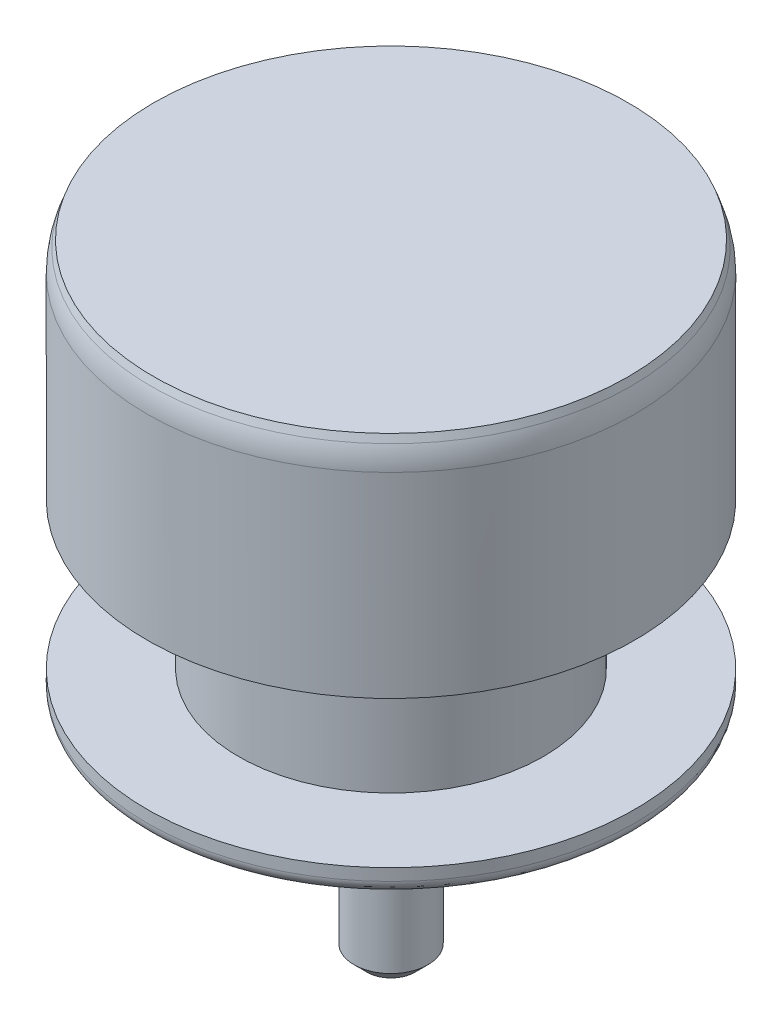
ISO-10303-21;
HEADER;
FILE_DESCRIPTION(('STEP AP214'),'2;1');
FILE_NAME('part.step','',(''),(''),'','','');
FILE_SCHEMA(('AUTOMOTIVE_DESIGN { 1 0 10303 214 1 1 1 1 }'));
ENDSEC;
DATA;
#1=APPLICATION_CONTEXT('core data for automotive mechanical design processes');
#2=APPLICATION_PROTOCOL_DEFINITION('international standard','automotive_design',2000,#1);
#3=PRODUCT_CONTEXT('',#1,'mechanical');
#4=PRODUCT('Part','Part','',(#3));
#5=PRODUCT_RELATED_PRODUCT_CATEGORY('part','',(#4));
#6=PRODUCT_DEFINITION_FORMATION('','',#4);
#7=PRODUCT_DEFINITION_CONTEXT('part definition',#1,'design');
#8=PRODUCT_DEFINITION('design','',#6,#7);
#9=PRODUCT_DEFINITION_SHAPE('','',#8);
#10=(LENGTH_UNIT() NAMED_UNIT(*) SI_UNIT(.MILLI.,.METRE.));
#11=(NAMED_UNIT(*) PLANE_ANGLE_UNIT() SI_UNIT($,.RADIAN.));
#12=(NAMED_UNIT(*) SI_UNIT($,.STERADIAN.) SOLID_ANGLE_UNIT());
#13=UNCERTAINTY_MEASURE_WITH_UNIT(LENGTH_MEASURE(1.E-05),#10,'distance_accuracy_value','');
#14=(GEOMETRIC_REPRESENTATION_CONTEXT(3) GLOBAL_UNCERTAINTY_ASSIGNED_CONTEXT((#13)) GLOBAL_UNIT_ASSIGNED_CONTEXT((#10,
#11,#12)) REPRESENTATION_CONTEXT('',''));
#15=CARTESIAN_POINT('',(0.,0.,0.));
#16=DIRECTION('',(0.,0.,1.));
#17=DIRECTION('',(1.,0.,0.));
#18=AXIS2_PLACEMENT_3D('',#15,#16,#17);
#19=CARTESIAN_POINT('',(3.66,0.,0.));
#20=DIRECTION('',(0.,-1.,0.));
#21=DIRECTION('',(1.,0.,0.));
#22=AXIS2_PLACEMENT_3D('',#19,#20,#21);
#23=PLANE('',#22);
#24=CARTESIAN_POINT('',(0.,0.,0.));
#25=DIRECTION('',(0.,1.,0.));
#26=DIRECTION('',(-1.,0.,0.));
#27=AXIS2_PLACEMENT_3D('',#24,#25,#26);
#28=CIRCLE('',#27,3.66);
#29=CARTESIAN_POINT('',(-3.66,0.,0.));
#30=VERTEX_POINT('',#29);
#31=EDGE_CURVE('E73',#30,#30,#28,.T.);
#32=ORIENTED_EDGE('',*,*,#31,.T.);
#33=EDGE_LOOP('',(#32));
#34=FACE_BOUND('',#33,.T.);
#35=ADVANCED_FACE('F32',(#34),#23,.F.);
#36=CARTESIAN_POINT('',(0.570000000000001,-9.6,0.));
#37=DIRECTION('',(0.,1.,0.));
#38=DIRECTION('',(-1.,0.,0.));
#39=AXIS2_PLACEMENT_3D('',#36,#37,#38);
#40=PLANE('',#39);
#41=CARTESIAN_POINT('',(0.,-9.6,0.));
#42=DIRECTION('',(0.,1.,0.));
#43=DIRECTION('',(-1.,0.,0.));
#44=AXIS2_PLACEMENT_3D('',#41,#42,#43);
#45=CIRCLE('',#44,0.369999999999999);
#46=CARTESIAN_POINT('',(-0.369999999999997,-9.6,0.));
#47=VERTEX_POINT('',#46);
#48=EDGE_CURVE('E10',#47,#47,#45,.F.);
#49=ORIENTED_EDGE('',*,*,#48,.T.);
#50=EDGE_LOOP('',(#49));
#51=FACE_BOUND('',#50,.T.);
#52=ADVANCED_FACE('F95',(#51),#40,.F.);
#53=CARTESIAN_POINT('',(0.,0.,0.));
#54=DIRECTION('',(0.,1.,0.));
#55=DIRECTION('',(-1.,0.,0.));
#56=AXIS2_PLACEMENT_3D('',#53,#54,#55);
#57=CYLINDRICAL_SURFACE('',#56,0.57);
#58=CARTESIAN_POINT('',(0.,-9.4,0.));
#59=DIRECTION('',(0.,1.,0.));
#60=DIRECTION('',(-1.,0.,0.));
#61=AXIS2_PLACEMENT_3D('',#58,#59,#60);
#62=CIRCLE('',#61,0.57);
#63=CARTESIAN_POINT('',(-0.569999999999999,-9.4,0.));
#64=VERTEX_POINT('',#63);
#65=EDGE_CURVE('E39',#64,#64,#62,.T.);
#66=ORIENTED_EDGE('',*,*,#65,.T.);
#67=EDGE_LOOP('',(#66));
#68=FACE_BOUND('',#67,.T.);
#69=CARTESIAN_POINT('',(0.,-7.87091034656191,0.));
#70=DIRECTION('',(0.,1.,0.));
#71=DIRECTION('',(-1.,0.,0.));
#72=AXIS2_PLACEMENT_3D('',#69,#70,#71);
#73=CIRCLE('',#72,0.57);
#74=CARTESIAN_POINT('',(-0.569999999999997,-7.87091034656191,0.));
#75=VERTEX_POINT('',#74);
#76=EDGE_CURVE('E58',#75,#75,#73,.T.);
#77=ORIENTED_EDGE('',*,*,#76,.F.);
#78=EDGE_LOOP('',(#77));
#79=FACE_BOUND('',#78,.T.);
#80=ADVANCED_FACE('F100',(#68,#79),#57,.T.);
#81=CARTESIAN_POINT('',(0.,-7.87091034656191,0.));
#82=DIRECTION('',(0.,1.,0.));
#83=DIRECTION('',(-1.,0.,0.));
#84=AXIS2_PLACEMENT_3D('',#81,#82,#83);
#85=CONICAL_SURFACE('',#84,0.57,1.04719755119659);
#86=CARTESIAN_POINT('',(0.,-6.08689801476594,0.));
#87=DIRECTION('',(0.,-1.,0.));
#88=DIRECTION('',(1.,0.,0.));
#89=AXIS2_PLACEMENT_3D('',#86,#87,#88);
#90=CIRCLE('',#89,3.66);
#91=CARTESIAN_POINT('',(-3.66,-6.08689801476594,0.));
#92=VERTEX_POINT('',#91);
#93=EDGE_CURVE('E52',#92,#92,#90,.T.);
#94=CARTESIAN_POINT('',(-3.66,-6.08689801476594,0.));
#95=CARTESIAN_POINT('',(-3.6278125,-6.10548147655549,0.));
#96=CARTESIAN_POINT('',(-3.595625,-6.12406493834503,0.));
#97=CARTESIAN_POINT('',(-3.53125,-6.16123186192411,0.));
#98=CARTESIAN_POINT('',(-3.4990625,-6.17981532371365,0.));
#99=CARTESIAN_POINT('',(-3.4346875,-6.21698224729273,0.));
#100=CARTESIAN_POINT('',(-3.4025,-6.23556570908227,0.));
#101=CARTESIAN_POINT('',(-3.338125,-6.27273263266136,0.));
#102=CARTESIAN_POINT('',(-3.3059375,-6.2913160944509,0.));
#103=CARTESIAN_POINT('',(-3.2415625,-6.32848301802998,0.));
#104=CARTESIAN_POINT('',(-3.209375,-6.34706647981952,0.));
#105=CARTESIAN_POINT('',(-3.145,-6.3842334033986,0.));
#106=CARTESIAN_POINT('',(-3.1128125,-6.40281686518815,0.));
#107=CARTESIAN_POINT('',(-3.0484375,-6.43998378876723,0.));
#108=CARTESIAN_POINT('',(-3.01625,-6.45856725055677,0.));
#109=CARTESIAN_POINT('',(-2.951875,-6.49573417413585,0.));
#110=CARTESIAN_POINT('',(-2.9196875,-6.51431763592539,0.));
#111=CARTESIAN_POINT('',(-2.8553125,-6.55148455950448,0.));
#112=CARTESIAN_POINT('',(-2.823125,-6.57006802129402,0.));
#113=CARTESIAN_POINT('',(-2.75875,-6.6072349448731,0.));
#114=CARTESIAN_POINT('',(-2.7265625,-6.62581840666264,0.));
#115=CARTESIAN_POINT('',(-2.6621875,-6.66298533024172,0.));
#116=CARTESIAN_POINT('',(-2.63,-6.68156879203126,0.));
#117=CARTESIAN_POINT('',(-2.565625,-6.71873571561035,0.));
#118=CARTESIAN_POINT('',(-2.5334375,-6.73731917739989,0.));
#119=CARTESIAN_POINT('',(-2.4690625,-6.77448610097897,0.));
#120=CARTESIAN_POINT('',(-2.436875,-6.79306956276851,0.));
#121=CARTESIAN_POINT('',(-2.3725,-6.8302364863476,0.));
#122=CARTESIAN_POINT('',(-2.3403125,-6.84881994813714,0.));
#123=CARTESIAN_POINT('',(-2.2759375,-6.88598687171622,0.));
#124=CARTESIAN_POINT('',(-2.24375,-6.90457033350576,0.));
#125=CARTESIAN_POINT('',(-2.179375,-6.94173725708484,0.));
#126=CARTESIAN_POINT('',(-2.1471875,-6.96032071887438,0.));
#127=CARTESIAN_POINT('',(-2.0828125,-6.99748764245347,0.));
#128=CARTESIAN_POINT('',(-2.050625,-7.01607110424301,0.));
#129=CARTESIAN_POINT('',(-1.98625,-7.05323802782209,0.));
#130=CARTESIAN_POINT('',(-1.9540625,-7.07182148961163,0.));
#131=CARTESIAN_POINT('',(-1.8896875,-7.10898841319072,0.));
#132=CARTESIAN_POINT('',(-1.8575,-7.12757187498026,0.));
#133=CARTESIAN_POINT('',(-1.793125,-7.16473879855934,0.));
#134=CARTESIAN_POINT('',(-1.7609375,-7.18332226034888,0.));
#135=CARTESIAN_POINT('',(-1.6965625,-7.22048918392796,0.));
#136=CARTESIAN_POINT('',(-1.664375,-7.2390726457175,0.));
#137=CARTESIAN_POINT('',(-1.6,-7.27623956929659,0.));
#138=CARTESIAN_POINT('',(-1.5678125,-7.29482303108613,0.));
#139=CARTESIAN_POINT('',(-1.5034375,-7.33198995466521,0.));
#140=CARTESIAN_POINT('',(-1.47125,-7.35057341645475,0.));
#141=CARTESIAN_POINT('',(-1.406875,-7.38774034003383,0.));
#142=CARTESIAN_POINT('',(-1.3746875,-7.40632380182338,0.));
#143=CARTESIAN_POINT('',(-1.3103125,-7.44349072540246,0.));
#144=CARTESIAN_POINT('',(-1.278125,-7.462074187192,0.));
#145=CARTESIAN_POINT('',(-1.21375,-7.49924111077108,0.));
#146=CARTESIAN_POINT('',(-1.1815625,-7.51782457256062,0.));
#147=CARTESIAN_POINT('',(-1.1171875,-7.55499149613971,0.));
#148=CARTESIAN_POINT('',(-1.085,-7.57357495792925,0.));
#149=CARTESIAN_POINT('',(-1.020625,-7.61074188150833,0.));
#150=CARTESIAN_POINT('',(-0.988437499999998,-7.62932534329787,0.));
#151=CARTESIAN_POINT('',(-0.924062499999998,-7.66649226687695,0.));
#152=CARTESIAN_POINT('',(-0.891874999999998,-7.6850757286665,0.));
#153=CARTESIAN_POINT('',(-0.827499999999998,-7.72224265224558,0.));
#154=CARTESIAN_POINT('',(-0.795312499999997,-7.74082611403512,0.));
#155=CARTESIAN_POINT('',(-0.730937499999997,-7.7779930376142,0.));
#156=CARTESIAN_POINT('',(-0.698749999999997,-7.79657649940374,0.));
#157=CARTESIAN_POINT('',(-0.634374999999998,-7.83374342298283,0.));
#158=CARTESIAN_POINT('',(-0.602187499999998,-7.85232688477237,0.));
#159=CARTESIAN_POINT('',(-0.569999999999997,-7.87091034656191,0.));
#160=B_SPLINE_CURVE_WITH_KNOTS('',3,(#94,#95,#96,#97,#98,#99,#100,#101,#102,#103,#104,#105,#106,
#107,#108,#109,#110,#111,#112,#113,#114,#115,#116,#117,#118,#119,#120,#121,#122,#123,#124,#125,
#126,#127,#128,#129,#130,#131,#132,#133,#134,#135,#136,#137,#138,#139,#140,#141,#142,#143,#144,
#145,#146,#147,#148,#149,#150,#151,#152,#153,#154,#155,#156,#157,#158,#159),.UNSPECIFIED.,.F.,
.F.,(4,2,2,2,2,2,2,2,2,2,2,2,2,2,2,2,2,2,2,2,2,2,2,2,2,2,2,2,2,2,2,2,4),(0.,0.111500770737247,
0.223001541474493,0.334502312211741,0.446003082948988,0.557503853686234,0.669004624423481,
0.780505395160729,0.892006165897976,1.00350693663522,1.11500770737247,1.22650847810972,
1.33800924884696,1.44951001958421,1.56101079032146,1.6725115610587,1.78401233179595,
1.8955131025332,2.00701387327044,2.11851464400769,2.23001541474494,2.34151618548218,
2.45301695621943,2.56451772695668,2.67601849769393,2.78751926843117,2.89902003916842,
3.01052080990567,3.12202158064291,3.23352235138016,3.34502312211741,3.45652389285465,
3.5680246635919),.UNSPECIFIED.);
#161=EDGE_CURVE('BSEAM134',#92,#75,#160,.T.);
#162=ORIENTED_EDGE('',*,*,#93,.T.);
#163=ORIENTED_EDGE('',*,*,#76,.T.);
#164=ORIENTED_EDGE('',*,*,#161,.T.);
#165=ORIENTED_EDGE('',*,*,#161,.F.);
#166=EDGE_LOOP('',(#162,#164,#163,#165));
#167=FACE_BOUND('',#166,.T.);
#168=ADVANCED_FACE('F134',(#167),#85,.T.);
#169=CARTESIAN_POINT('',(0.,0.,0.));
#170=DIRECTION('',(0.,1.,0.));
#171=DIRECTION('',(-1.,0.,0.));
#172=AXIS2_PLACEMENT_3D('',#169,#170,#171);
#173=CYLINDRICAL_SURFACE('',#172,3.76);
#174=CARTESIAN_POINT('',(0.,-5.91369293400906,0.));
#175=DIRECTION('',(0.,-1.,0.));
#176=DIRECTION('',(1.,0.,0.));
#177=AXIS2_PLACEMENT_3D('',#174,#175,#176);
#178=CIRCLE('',#177,3.76);
#179=CARTESIAN_POINT('',(3.76,-5.91369293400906,0.));
#180=VERTEX_POINT('',#179);
#181=EDGE_CURVE('E55',#180,#180,#178,.F.);
#182=ORIENTED_EDGE('',*,*,#181,.T.);
#183=EDGE_LOOP('',(#182));
#184=FACE_BOUND('',#183,.T.);
#185=CARTESIAN_POINT('',(0.,-5.73,0.));
#186=DIRECTION('',(0.,1.,0.));
#187=DIRECTION('',(-1.,0.,0.));
#188=AXIS2_PLACEMENT_3D('',#185,#186,#187);
#189=CIRCLE('',#188,3.76);
#190=CARTESIAN_POINT('',(-3.76,-5.73,0.));
#191=VERTEX_POINT('',#190);
#192=EDGE_CURVE('E61',#191,#191,#189,.T.);
#193=ORIENTED_EDGE('',*,*,#192,.F.);
#194=EDGE_LOOP('',(#193));
#195=FACE_BOUND('',#194,.T.);
#196=ADVANCED_FACE('F129',(#184,#195),#173,.T.);
#197=CARTESIAN_POINT('',(3.76,-5.73,0.));
#198=DIRECTION('',(0.,-1.,0.));
#199=DIRECTION('',(1.,0.,0.));
#200=AXIS2_PLACEMENT_3D('',#197,#198,#199);
#201=PLANE('',#200);
#202=CARTESIAN_POINT('',(0.,-5.73,0.));
#203=DIRECTION('',(0.,1.,0.));
#204=DIRECTION('',(-1.,0.,0.));
#205=AXIS2_PLACEMENT_3D('',#202,#203,#204);
#206=CIRCLE('',#205,2.35);
#207=CARTESIAN_POINT('',(-2.35,-5.73,0.));
#208=VERTEX_POINT('',#207);
#209=EDGE_CURVE('E64',#208,#208,#206,.T.);
#210=ORIENTED_EDGE('',*,*,#209,.F.);
#211=EDGE_LOOP('',(#210));
#212=FACE_BOUND('',#211,.T.);
#213=ORIENTED_EDGE('',*,*,#192,.T.);
#214=EDGE_LOOP('',(#213));
#215=FACE_BOUND('',#214,.T.);
#216=ADVANCED_FACE('F123',(#212,#215),#201,.F.);
#217=CARTESIAN_POINT('',(0.,0.,0.));
#218=DIRECTION('',(0.,1.,0.));
#219=DIRECTION('',(-1.,0.,0.));
#220=AXIS2_PLACEMENT_3D('',#217,#218,#219);
#221=CYLINDRICAL_SURFACE('',#220,2.35);
#222=CARTESIAN_POINT('',(0.,-3.47,0.));
#223=DIRECTION('',(0.,1.,0.));
#224=DIRECTION('',(-1.,0.,0.));
#225=AXIS2_PLACEMENT_3D('',#222,#223,#224);
#226=CIRCLE('',#225,2.35);
#227=CARTESIAN_POINT('',(-2.35,-3.47,0.));
#228=VERTEX_POINT('',#227);
#229=EDGE_CURVE('E67',#228,#228,#226,.T.);
#230=ORIENTED_EDGE('',*,*,#229,.F.);
#231=EDGE_LOOP('',(#230));
#232=FACE_BOUND('',#231,.T.);
#233=ORIENTED_EDGE('',*,*,#209,.T.);
#234=EDGE_LOOP('',(#233));
#235=FACE_BOUND('',#234,.T.);
#236=ADVANCED_FACE('F117',(#232,#235),#221,.T.);
#237=CARTESIAN_POINT('',(2.35,-3.47,0.));
#238=DIRECTION('',(0.,1.,0.));
#239=DIRECTION('',(-1.,0.,0.));
#240=AXIS2_PLACEMENT_3D('',#237,#238,#239);
#241=PLANE('',#240);
#242=CARTESIAN_POINT('',(0.,-3.47,0.));
#243=DIRECTION('',(0.,1.,0.));
#244=DIRECTION('',(-1.,0.,0.));
#245=AXIS2_PLACEMENT_3D('',#242,#243,#244);
#246=CIRCLE('',#245,3.76);
#247=CARTESIAN_POINT('',(-3.76,-3.47,0.));
#248=VERTEX_POINT('',#247);
#249=EDGE_CURVE('E70',#248,#248,#246,.T.);
#250=ORIENTED_EDGE('',*,*,#249,.F.);
#251=EDGE_LOOP('',(#250));
#252=FACE_BOUND('',#251,.T.);
#253=ORIENTED_EDGE('',*,*,#229,.T.);
#254=EDGE_LOOP('',(#253));
#255=FACE_BOUND('',#254,.T.);
#256=ADVANCED_FACE('F91',(#252,#255),#241,.F.);
#257=CARTESIAN_POINT('',(0.,0.,0.));
#258=DIRECTION('',(0.,1.,0.));
#259=DIRECTION('',(-1.,0.,0.));
#260=AXIS2_PLACEMENT_3D('',#257,#258,#259);
#261=CYLINDRICAL_SURFACE('',#260,3.76);
#262=CARTESIAN_POINT('',(0.,-0.451074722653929,0.));
#263=DIRECTION('',(0.,-1.,0.));
#264=DIRECTION('',(1.,0.,0.));
#265=AXIS2_PLACEMENT_3D('',#262,#263,#264);
#266=CIRCLE('',#265,3.76);
#267=CARTESIAN_POINT('',(3.76,-0.451074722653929,0.));
#268=VERTEX_POINT('',#267);
#269=EDGE_CURVE('E43',#268,#268,#266,.T.);
#270=ORIENTED_EDGE('',*,*,#269,.T.);
#271=EDGE_LOOP('',(#270));
#272=FACE_BOUND('',#271,.T.);
#273=ORIENTED_EDGE('',*,*,#249,.T.);
#274=EDGE_LOOP('',(#273));
#275=FACE_BOUND('',#274,.T.);
#276=ADVANCED_FACE('F81',(#272,#275),#261,.T.);
#277=CARTESIAN_POINT('',(0.,-0.274747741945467,0.));
#278=DIRECTION('',(0.,-1.,0.));
#279=DIRECTION('',(1.,0.,0.));
#280=AXIS2_PLACEMENT_3D('',#277,#278,#279);
#281=CONICAL_SURFACE('',#280,3.76,0.34906585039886);
#282=CARTESIAN_POINT('',(0.,-0.109054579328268,0.));
#283=DIRECTION('',(0.,1.,0.));
#284=DIRECTION('',(-1.,0.,0.));
#285=AXIS2_PLACEMENT_3D('',#282,#283,#284);
#286=CIRCLE('',#285,3.69969262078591);
#287=CARTESIAN_POINT('',(-3.69969262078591,-0.109054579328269,0.));
#288=VERTEX_POINT('',#287);
#289=EDGE_CURVE('E47',#288,#288,#286,.T.);
#290=ORIENTED_EDGE('',*,*,#289,.T.);
#291=EDGE_LOOP('',(#290));
#292=FACE_BOUND('',#291,.T.);
#293=ORIENTED_EDGE('',*,*,#31,.F.);
#294=EDGE_LOOP('',(#293));
#295=FACE_BOUND('',#294,.T.);
#296=ADVANCED_FACE('F78',(#292,#295),#281,.T.);
#297=CARTESIAN_POINT('',(0.,-5.91369293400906,0.));
#298=DIRECTION('',(0.,-1.,0.));
#299=DIRECTION('',(1.,0.,0.));
#300=AXIS2_PLACEMENT_3D('',#297,#298,#299);
#301=TOROIDAL_SURFACE('',#300,3.56,0.2);
#302=ORIENTED_EDGE('',*,*,#93,.F.);
#303=EDGE_LOOP('',(#302));
#304=FACE_BOUND('',#303,.T.);
#305=ORIENTED_EDGE('',*,*,#181,.F.);
#306=EDGE_LOOP('',(#305));
#307=FACE_BOUND('',#306,.T.);
#308=ADVANCED_FACE('F80',(#304,#307),#301,.T.);
#309=CARTESIAN_POINT('',(0.,-0.451074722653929,0.));
#310=DIRECTION('',(0.,-1.,0.));
#311=DIRECTION('',(1.,0.,0.));
#312=AXIS2_PLACEMENT_3D('',#309,#310,#311);
#313=TOROIDAL_SURFACE('',#312,2.76,1.);
#314=ORIENTED_EDGE('',*,*,#269,.F.);
#315=EDGE_LOOP('',(#314));
#316=FACE_BOUND('',#315,.T.);
#317=ORIENTED_EDGE('',*,*,#289,.F.);
#318=EDGE_LOOP('',(#317));
#319=FACE_BOUND('',#318,.T.);
#320=ADVANCED_FACE('F88',(#316,#319),#313,.T.);
#321=CARTESIAN_POINT('',(0.,-9.4,0.));
#322=DIRECTION('',(0.,1.,0.));
#323=DIRECTION('',(-1.,0.,0.));
#324=AXIS2_PLACEMENT_3D('',#321,#322,#323);
#325=CONICAL_SURFACE('',#324,0.57,0.785398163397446);
#326=ORIENTED_EDGE('',*,*,#48,.F.);
#327=EDGE_LOOP('',(#326));
#328=FACE_BOUND('',#327,.T.);
#329=ORIENTED_EDGE('',*,*,#65,.F.);
#330=EDGE_LOOP('',(#329));
#331=FACE_BOUND('',#330,.T.);
#332=ADVANCED_FACE('F34',(#328,#331),#325,.T.);
#333=CLOSED_SHELL('',(#35,#52,#80,#168,#196,#216,#236,#256,#276,#296,#308,#320,#332));
#334=MANIFOLD_SOLID_BREP('B2',#333);
#335=ADVANCED_BREP_SHAPE_REPRESENTATION('',(#18,#334),#14);
#336=SHAPE_DEFINITION_REPRESENTATION(#9,#335);
ENDSEC;
END-ISO-10303-21;
